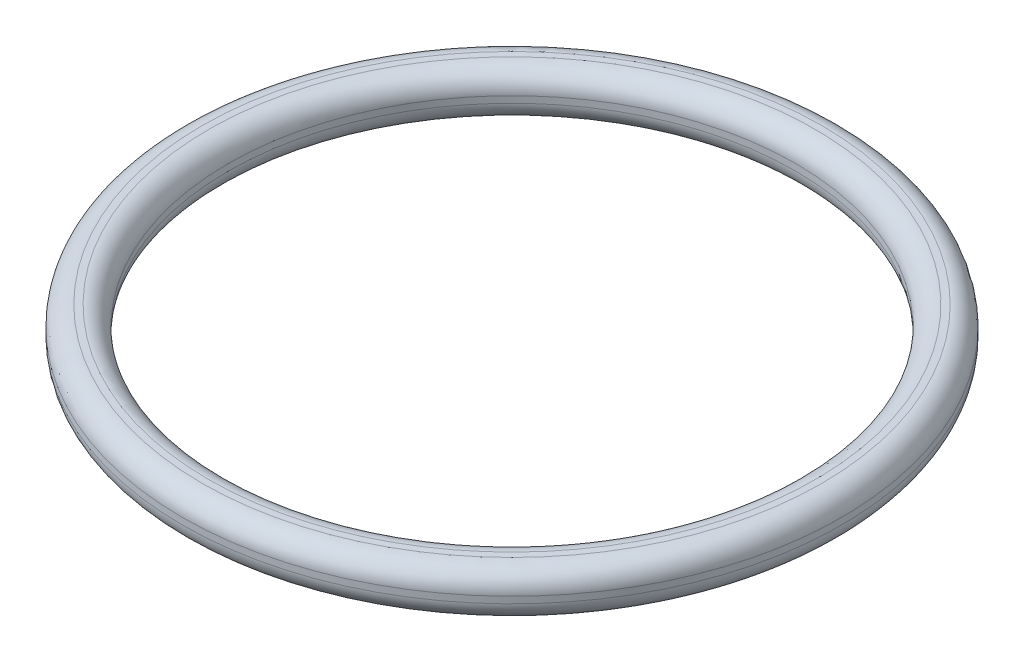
ISO-10303-21;
HEADER;
FILE_DESCRIPTION(('STEP AP214'),'2;1');
FILE_NAME('part.step','',(''),(''),'','','');
FILE_SCHEMA(('AUTOMOTIVE_DESIGN { 1 0 10303 214 1 1 1 1 }'));
ENDSEC;
DATA;
#1=APPLICATION_CONTEXT('core data for automotive mechanical design processes');
#2=APPLICATION_PROTOCOL_DEFINITION('international standard','automotive_design',2000,#1);
#3=PRODUCT_CONTEXT('',#1,'mechanical');
#4=PRODUCT('Part','Part','',(#3));
#5=PRODUCT_RELATED_PRODUCT_CATEGORY('part','',(#4));
#6=PRODUCT_DEFINITION_FORMATION('','',#4);
#7=PRODUCT_DEFINITION_CONTEXT('part definition',#1,'design');
#8=PRODUCT_DEFINITION('design','',#6,#7);
#9=PRODUCT_DEFINITION_SHAPE('','',#8);
#10=(LENGTH_UNIT() NAMED_UNIT(*) SI_UNIT(.MILLI.,.METRE.));
#11=(NAMED_UNIT(*) PLANE_ANGLE_UNIT() SI_UNIT($,.RADIAN.));
#12=(NAMED_UNIT(*) SI_UNIT($,.STERADIAN.) SOLID_ANGLE_UNIT());
#13=UNCERTAINTY_MEASURE_WITH_UNIT(LENGTH_MEASURE(1.E-05),#10,'distance_accuracy_value','');
#14=(GEOMETRIC_REPRESENTATION_CONTEXT(3) GLOBAL_UNCERTAINTY_ASSIGNED_CONTEXT((#13)) GLOBAL_UNIT_ASSIGNED_CONTEXT((#10,
#11,#12)) REPRESENTATION_CONTEXT('',''));
#15=CARTESIAN_POINT('',(0.,0.,0.));
#16=DIRECTION('',(0.,0.,1.));
#17=DIRECTION('',(1.,0.,0.));
#18=AXIS2_PLACEMENT_3D('',#15,#16,#17);
#19=CARTESIAN_POINT('',(0.,1.778,0.));
#20=DIRECTION('',(0.,1.,0.));
#21=DIRECTION('',(0.,0.,1.));
#22=AXIS2_PLACEMENT_3D('',#19,#20,#21);
#23=PLANE('',#22);
#24=CARTESIAN_POINT('',(0.,1.778,0.));
#25=DIRECTION('',(0.,1.,0.));
#26=DIRECTION('',(0.,0.,1.));
#27=AXIS2_PLACEMENT_3D('',#24,#25,#26);
#28=CIRCLE('',#27,11.9888);
#29=CARTESIAN_POINT('',(0.,1.778,11.9888));
#30=VERTEX_POINT('',#29);
#31=EDGE_CURVE('E44',#30,#30,#28,.T.);
#32=ORIENTED_EDGE('',*,*,#31,.T.);
#33=EDGE_LOOP('',(#32));
#34=FACE_BOUND('',#33,.T.);
#35=CARTESIAN_POINT('',(0.,1.778,0.));
#36=DIRECTION('',(0.,1.,0.));
#37=DIRECTION('',(0.,0.,1.));
#38=AXIS2_PLACEMENT_3D('',#35,#36,#37);
#39=CIRCLE('',#38,11.7348);
#40=CARTESIAN_POINT('',(0.,1.778,11.7348));
#41=VERTEX_POINT('',#40);
#42=EDGE_CURVE('E48',#41,#41,#39,.F.);
#43=ORIENTED_EDGE('',*,*,#42,.T.);
#44=EDGE_LOOP('',(#43));
#45=FACE_BOUND('',#44,.T.);
#46=ADVANCED_FACE('F33',(#34,#45),#23,.T.);
#47=CARTESIAN_POINT('',(0.,0.,0.));
#48=DIRECTION('',(0.,1.,0.));
#49=DIRECTION('',(0.,0.,1.));
#50=AXIS2_PLACEMENT_3D('',#47,#48,#49);
#51=PLANE('',#50);
#52=CARTESIAN_POINT('',(0.,0.,0.));
#53=DIRECTION('',(0.,1.,0.));
#54=DIRECTION('',(0.,0.,1.));
#55=AXIS2_PLACEMENT_3D('',#52,#53,#54);
#56=CIRCLE('',#55,11.9888);
#57=CARTESIAN_POINT('',(0.,0.,11.9888));
#58=VERTEX_POINT('',#57);
#59=EDGE_CURVE('E53',#58,#58,#56,.F.);
#60=ORIENTED_EDGE('',*,*,#59,.T.);
#61=EDGE_LOOP('',(#60));
#62=FACE_BOUND('',#61,.T.);
#63=CARTESIAN_POINT('',(0.,0.,0.));
#64=DIRECTION('',(0.,1.,0.));
#65=DIRECTION('',(0.,0.,1.));
#66=AXIS2_PLACEMENT_3D('',#63,#64,#65);
#67=CIRCLE('',#66,11.7348);
#68=CARTESIAN_POINT('',(0.,0.,11.7348));
#69=VERTEX_POINT('',#68);
#70=EDGE_CURVE('E56',#69,#69,#67,.T.);
#71=ORIENTED_EDGE('',*,*,#70,.T.);
#72=EDGE_LOOP('',(#71));
#73=FACE_BOUND('',#72,.T.);
#74=ADVANCED_FACE('F78',(#62,#73),#51,.F.);
#75=CARTESIAN_POINT('',(0.,1.778,0.));
#76=DIRECTION('',(0.,-1.,0.));
#77=DIRECTION('',(0.,0.,-1.));
#78=AXIS2_PLACEMENT_3D('',#75,#76,#77);
#79=CYLINDRICAL_SURFACE('',#78,12.7508);
#80=CARTESIAN_POINT('',(0.,0.762,0.));
#81=DIRECTION('',(0.,1.,0.));
#82=DIRECTION('',(0.,0.,1.));
#83=AXIS2_PLACEMENT_3D('',#80,#81,#82);
#84=CIRCLE('',#83,12.7508);
#85=CARTESIAN_POINT('',(0.,0.762,12.7508));
#86=VERTEX_POINT('',#85);
#87=EDGE_CURVE('E59',#86,#86,#84,.T.);
#88=ORIENTED_EDGE('',*,*,#87,.T.);
#89=EDGE_LOOP('',(#88));
#90=FACE_BOUND('',#89,.T.);
#91=CARTESIAN_POINT('',(0.,1.016,0.));
#92=DIRECTION('',(0.,1.,0.));
#93=DIRECTION('',(0.,0.,1.));
#94=AXIS2_PLACEMENT_3D('',#91,#92,#93);
#95=CIRCLE('',#94,12.7508);
#96=CARTESIAN_POINT('',(0.,1.016,12.7508));
#97=VERTEX_POINT('',#96);
#98=EDGE_CURVE('E62',#97,#97,#95,.F.);
#99=ORIENTED_EDGE('',*,*,#98,.T.);
#100=EDGE_LOOP('',(#99));
#101=FACE_BOUND('',#100,.T.);
#102=ADVANCED_FACE('F66',(#90,#101),#79,.T.);
#103=CARTESIAN_POINT('',(0.,1.778,0.));
#104=DIRECTION('',(0.,-1.,0.));
#105=DIRECTION('',(0.,0.,-1.));
#106=AXIS2_PLACEMENT_3D('',#103,#104,#105);
#107=CYLINDRICAL_SURFACE('',#106,10.9728);
#108=CARTESIAN_POINT('',(0.,1.016,0.));
#109=DIRECTION('',(0.,1.,0.));
#110=DIRECTION('',(0.,0.,1.));
#111=AXIS2_PLACEMENT_3D('',#108,#109,#110);
#112=CIRCLE('',#111,10.9728);
#113=CARTESIAN_POINT('',(0.,1.016,10.9728));
#114=VERTEX_POINT('',#113);
#115=EDGE_CURVE('E10',#114,#114,#112,.T.);
#116=ORIENTED_EDGE('',*,*,#115,.T.);
#117=EDGE_LOOP('',(#116));
#118=FACE_BOUND('',#117,.T.);
#119=CARTESIAN_POINT('',(0.,0.762,0.));
#120=DIRECTION('',(0.,1.,0.));
#121=DIRECTION('',(0.,0.,1.));
#122=AXIS2_PLACEMENT_3D('',#119,#120,#121);
#123=CIRCLE('',#122,10.9728);
#124=CARTESIAN_POINT('',(0.,0.762,10.9728));
#125=VERTEX_POINT('',#124);
#126=EDGE_CURVE('E40',#125,#125,#123,.F.);
#127=ORIENTED_EDGE('',*,*,#126,.T.);
#128=EDGE_LOOP('',(#127));
#129=FACE_BOUND('',#128,.T.);
#130=ADVANCED_FACE('F91',(#118,#129),#107,.F.);
#131=CARTESIAN_POINT('',(0.,0.762,0.));
#132=DIRECTION('',(0.,1.,0.));
#133=DIRECTION('',(0.,0.,1.));
#134=AXIS2_PLACEMENT_3D('',#131,#132,#133);
#135=TOROIDAL_SURFACE('',#134,11.9888,0.762);
#136=ORIENTED_EDGE('',*,*,#59,.F.);
#137=EDGE_LOOP('',(#136));
#138=FACE_BOUND('',#137,.T.);
#139=ORIENTED_EDGE('',*,*,#87,.F.);
#140=EDGE_LOOP('',(#139));
#141=FACE_BOUND('',#140,.T.);
#142=ADVANCED_FACE('F72',(#138,#141),#135,.T.);
#143=CARTESIAN_POINT('',(0.,1.016,0.));
#144=DIRECTION('',(0.,1.,0.));
#145=DIRECTION('',(0.,0.,1.));
#146=AXIS2_PLACEMENT_3D('',#143,#144,#145);
#147=TOROIDAL_SURFACE('',#146,11.9888,0.762);
#148=ORIENTED_EDGE('',*,*,#98,.F.);
#149=EDGE_LOOP('',(#148));
#150=FACE_BOUND('',#149,.T.);
#151=ORIENTED_EDGE('',*,*,#31,.F.);
#152=EDGE_LOOP('',(#151));
#153=FACE_BOUND('',#152,.T.);
#154=ADVANCED_FACE('F68',(#150,#153),#147,.T.);
#155=CARTESIAN_POINT('',(0.,1.016,0.));
#156=DIRECTION('',(0.,1.,0.));
#157=DIRECTION('',(0.,0.,1.));
#158=AXIS2_PLACEMENT_3D('',#155,#156,#157);
#159=TOROIDAL_SURFACE('',#158,11.7348,0.762);
#160=ORIENTED_EDGE('',*,*,#42,.F.);
#161=EDGE_LOOP('',(#160));
#162=FACE_BOUND('',#161,.T.);
#163=ORIENTED_EDGE('',*,*,#115,.F.);
#164=EDGE_LOOP('',(#163));
#165=FACE_BOUND('',#164,.T.);
#166=ADVANCED_FACE('F71',(#162,#165),#159,.T.);
#167=CARTESIAN_POINT('',(0.,0.762,0.));
#168=DIRECTION('',(0.,1.,0.));
#169=DIRECTION('',(0.,0.,1.));
#170=AXIS2_PLACEMENT_3D('',#167,#168,#169);
#171=TOROIDAL_SURFACE('',#170,11.7348,0.762);
#172=ORIENTED_EDGE('',*,*,#126,.F.);
#173=EDGE_LOOP('',(#172));
#174=FACE_BOUND('',#173,.T.);
#175=ORIENTED_EDGE('',*,*,#70,.F.);
#176=EDGE_LOOP('',(#175));
#177=FACE_BOUND('',#176,.T.);
#178=ADVANCED_FACE('F35',(#174,#177),#171,.T.);
#179=CLOSED_SHELL('',(#46,#74,#102,#130,#142,#154,#166,#178));
#180=MANIFOLD_SOLID_BREP('B2',#179);
#181=ADVANCED_BREP_SHAPE_REPRESENTATION('',(#18,#180),#14);
#182=SHAPE_DEFINITION_REPRESENTATION(#9,#181);
ENDSEC;
END-ISO-10303-21;
